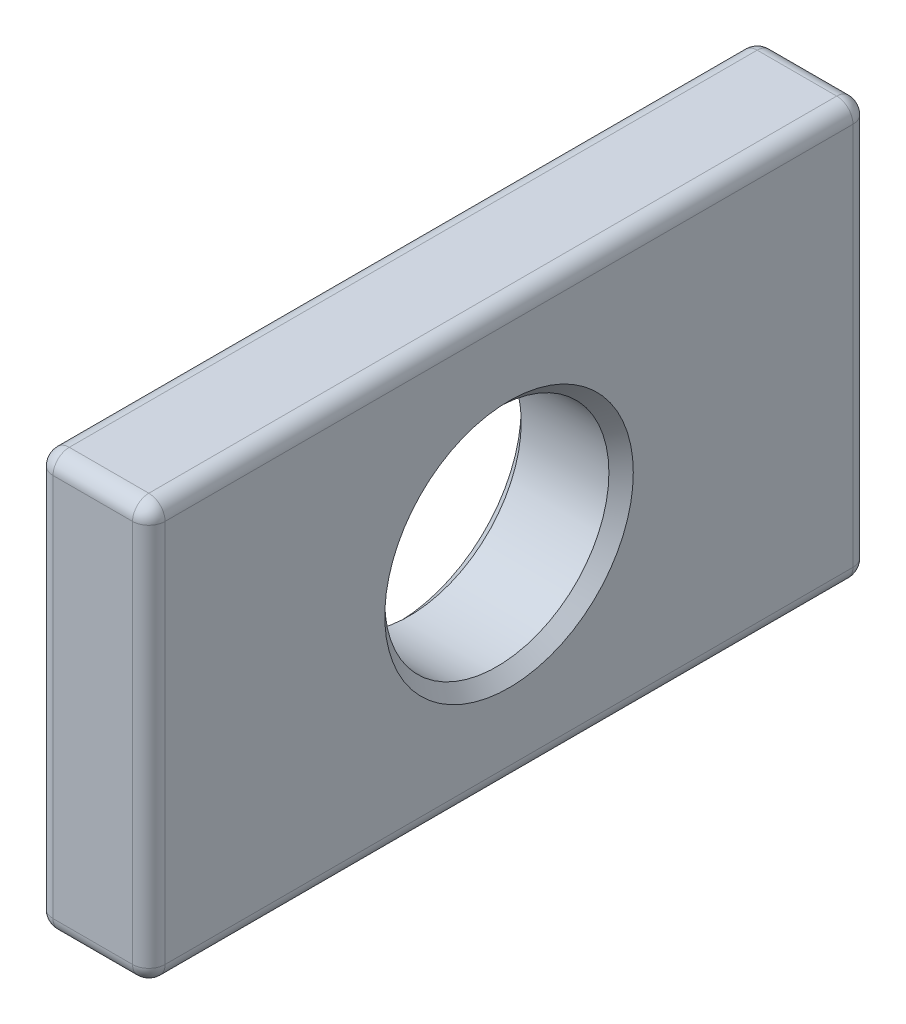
from build123d import *

# Parameters (mm, degrees)
SKETCH1_W           = 45
SKETCH1_H           = 26
SKETCH1_R           = 7
BOSS_EXTRUDE1_DEPTH = 3.5
FILLET1_R           = 1.016
CHAMFER1_SIZE       = 0.762


with BuildPart() as part:
    # Sketch1 → Boss-Extrude1 (new, symmetric)
    with BuildSketch(Plane(origin=(0, 0, 0), x_dir=(0, 0, -1), z_dir=(1, 0, 0))):
        Rectangle(SKETCH1_W, SKETCH1_H)
        Circle(SKETCH1_R, mode=Mode.SUBTRACT)
    extrude(amount=BOSS_EXTRUDE1_DEPTH, both=True)

    # Fillet1
    fillet1_edges = [part.edges().sort_by_distance(p)[0] for p in [
        (3.5, 0, 22.5),
        (3.5, -13, 0),
        (3.5, 0, -22.5),
        (-3.5, -13, 0),
        (-3.5, 0, 22.5),
        (-3.5, 13, 0),
        (-3.5, 0, -22.5),
        (3.5, 13, 0),
        (0, -13, -22.5),
        (0, -13, 22.5),
        (0, 13, 22.5),
        (0, 13, -22.5),
    ]]
    fillet(fillet1_edges, radius=FILLET1_R)

    # Chamfer1
    chamfer1_edges = [part.edges().sort_by_distance(p)[0] for p in [
        (-3.5, 0, 7),
        (3.5, 0, 7),
    ]]
    chamfer(chamfer1_edges, length=CHAMFER1_SIZE)


solid = part.part
